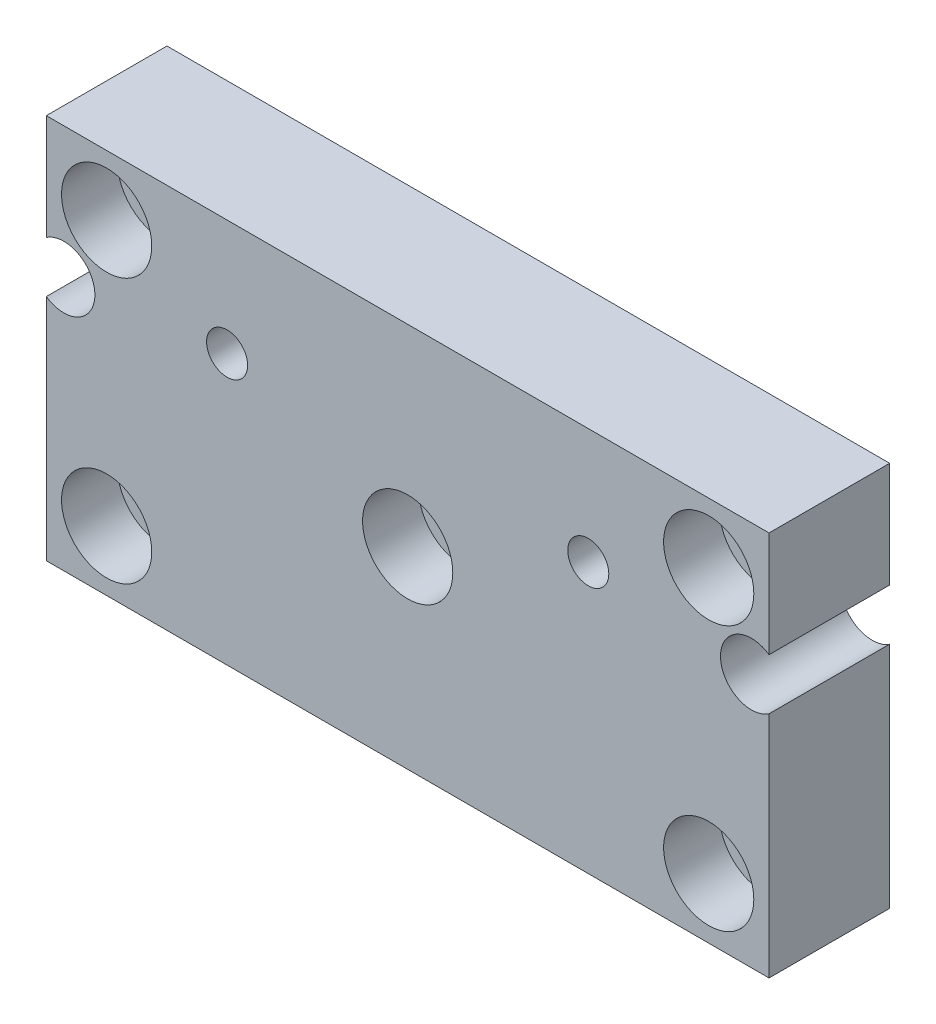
from build123d import *

# Parameters (mm, degrees)
SKETCH1_W             = 47.625
SKETCH1_H             = 25.4
EXTRUDE1_DEPTH        = 7.9502
SKETCH3_R             = 1.778
CUT_EXTRUDE1_DEPTH    = 29.134157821
SKETCH4_R             = 2.9718
CUT_EXTRUDE2_DEPTH    = 3.683
SKETCH5_R             = 2.0447
CUT_EXTRUDE3_DEPTH    = 29.134157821
F_6_32_TAPPED_HOLE1_D = 2.7051


with BuildPart() as part:
    # Sketch1 → Extrude1 (new body)
    with BuildSketch(Plane.XY):
        Rectangle(SKETCH1_W, SKETCH1_H)
    extrude(amount=-EXTRUDE1_DEPTH)

    # Sketch3 → Cut-Extrude1 (cut, through all)
    with BuildSketch(Plane.XY):
        with Locations((19.8374, 8.7249)):
            Circle(SKETCH3_R)
        with Locations((19.8374, -8.7249)):
            Circle(SKETCH3_R)
        with Locations((-19.8374, -8.7249)):
            Circle(SKETCH3_R)
        with Locations((-19.8374, 8.7249)):
            Circle(SKETCH3_R)
        Circle(SKETCH3_R)
    extrude(amount=-CUT_EXTRUDE1_DEPTH, mode=Mode.SUBTRACT)

    # Sketch4 → Cut-Extrude2 (cut)
    with BuildSketch(Plane.XY):
        with Locations((19.8374, 8.7249)):
            Circle(SKETCH4_R)
        with Locations((19.8374, -8.7249)):
            Circle(SKETCH4_R)
        with Locations((-19.8374, -8.7249)):
            Circle(SKETCH4_R)
        with Locations((-19.8374, 8.7249)):
            Circle(SKETCH4_R)
        Circle(SKETCH4_R)
    extrude(amount=-CUT_EXTRUDE2_DEPTH, mode=Mode.SUBTRACT)

    # Sketch5 → Cut-Extrude3 (cut, through all)
    with BuildSketch(Plane.XY):
        with Locations((22.6568, 4.064)):
            Circle(SKETCH5_R)
        with Locations((-22.6568, 4.064)):
            Circle(SKETCH5_R)
    extrude(amount=-CUT_EXTRUDE3_DEPTH, mode=Mode.SUBTRACT)

    # 6-32 Tapped Hole1 (through all)
    with Locations(Plane.XY):
        with Locations((-11.8999, 5.08), (11.8999, 5.08)):
            Hole(F_6_32_TAPPED_HOLE1_D / 2)


solid = part.part
